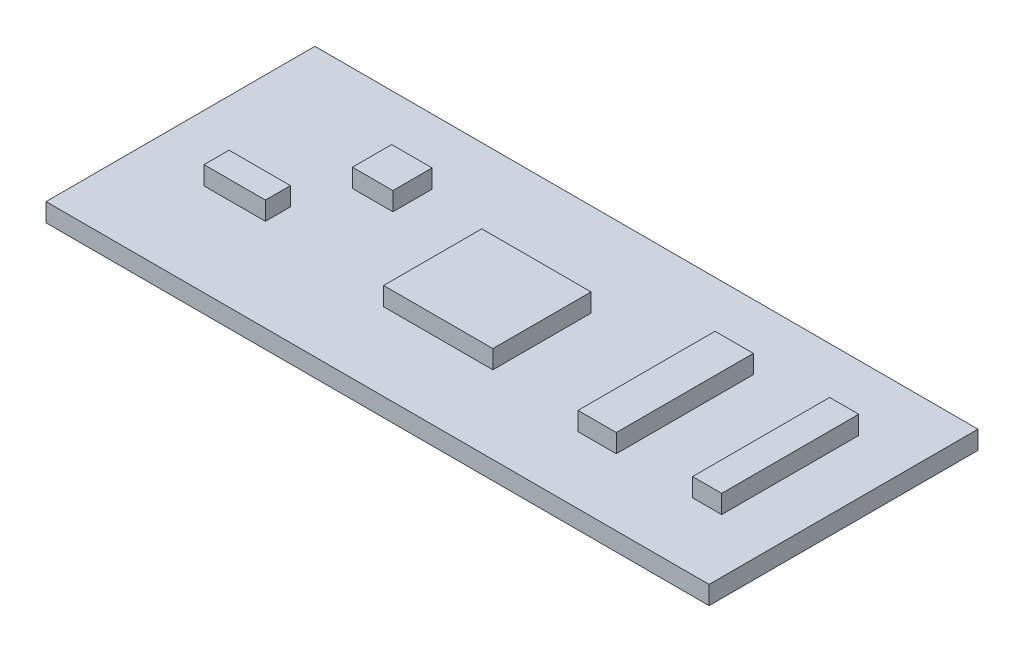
ISO-10303-21;
HEADER;
FILE_DESCRIPTION(('STEP AP214'),'2;1');
FILE_NAME('part.step','',(''),(''),'','','');
FILE_SCHEMA(('AUTOMOTIVE_DESIGN { 1 0 10303 214 1 1 1 1 }'));
ENDSEC;
DATA;
#1=APPLICATION_CONTEXT('core data for automotive mechanical design processes');
#2=APPLICATION_PROTOCOL_DEFINITION('international standard','automotive_design',2000,#1);
#3=PRODUCT_CONTEXT('',#1,'mechanical');
#4=PRODUCT('Part','Part','',(#3));
#5=PRODUCT_RELATED_PRODUCT_CATEGORY('part','',(#4));
#6=PRODUCT_DEFINITION_FORMATION('','',#4);
#7=PRODUCT_DEFINITION_CONTEXT('part definition',#1,'design');
#8=PRODUCT_DEFINITION('design','',#6,#7);
#9=PRODUCT_DEFINITION_SHAPE('','',#8);
#10=(LENGTH_UNIT() NAMED_UNIT(*) SI_UNIT(.MILLI.,.METRE.));
#11=(NAMED_UNIT(*) PLANE_ANGLE_UNIT() SI_UNIT($,.RADIAN.));
#12=(NAMED_UNIT(*) SI_UNIT($,.STERADIAN.) SOLID_ANGLE_UNIT());
#13=UNCERTAINTY_MEASURE_WITH_UNIT(LENGTH_MEASURE(1.E-05),#10,'distance_accuracy_value','');
#14=(GEOMETRIC_REPRESENTATION_CONTEXT(3) GLOBAL_UNCERTAINTY_ASSIGNED_CONTEXT((#13)) GLOBAL_UNIT_ASSIGNED_CONTEXT((#10,
#11,#12)) REPRESENTATION_CONTEXT('',''));
#15=CARTESIAN_POINT('',(0.,0.,0.));
#16=DIRECTION('',(0.,0.,1.));
#17=DIRECTION('',(1.,0.,0.));
#18=AXIS2_PLACEMENT_3D('',#15,#16,#17);
#19=CARTESIAN_POINT('',(0.,1.5,-21.9));
#20=DIRECTION('',(0.,1.,0.));
#21=DIRECTION('',(0.,0.,1.));
#22=AXIS2_PLACEMENT_3D('',#19,#20,#21);
#23=PLANE('',#22);
#24=DIRECTION('',(1.,0.,0.));
#25=VECTOR('',#24,1.);
#26=CARTESIAN_POINT('',(11.5516885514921,1.5,-13.403085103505));
#27=LINE('',#26,#25);
#28=CARTESIAN_POINT('',(11.5516885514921,1.5,-13.403085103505));
#29=VERTEX_POINT('',#28);
#30=CARTESIAN_POINT('',(14.846633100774,1.50000000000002,-13.403085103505));
#31=VERTEX_POINT('',#30);
#32=EDGE_CURVE('E243',#29,#31,#27,.T.);
#33=ORIENTED_EDGE('',*,*,#32,.F.);
#34=DIRECTION('',(0.,0.,1.));
#35=VECTOR('',#34,1.);
#36=CARTESIAN_POINT('',(11.5516885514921,1.49999999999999,-16.5958756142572));
#37=LINE('',#36,#35);
#38=CARTESIAN_POINT('',(11.5516885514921,1.49999999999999,-16.5958756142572));
#39=VERTEX_POINT('',#38);
#40=EDGE_CURVE('E212',#39,#29,#37,.T.);
#41=ORIENTED_EDGE('',*,*,#40,.F.);
#42=DIRECTION('',(-1.,0.,0.));
#43=VECTOR('',#42,1.);
#44=CARTESIAN_POINT('',(11.5516885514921,1.49999999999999,-16.5958756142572));
#45=LINE('',#44,#43);
#46=CARTESIAN_POINT('',(14.8466331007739,1.49999999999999,-16.5958756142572));
#47=VERTEX_POINT('',#46);
#48=EDGE_CURVE('E247',#47,#39,#45,.T.);
#49=ORIENTED_EDGE('',*,*,#48,.F.);
#50=DIRECTION('',(0.,0.,-1.));
#51=VECTOR('',#50,1.);
#52=CARTESIAN_POINT('',(14.8466331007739,1.49999999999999,-16.5958756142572));
#53=LINE('',#52,#51);
#54=EDGE_CURVE('E245',#31,#47,#53,.T.);
#55=ORIENTED_EDGE('',*,*,#54,.F.);
#56=EDGE_LOOP('',(#33,#41,#49,#55));
#57=FACE_BOUND('',#56,.T.);
#58=DIRECTION('',(0.,0.,-1.));
#59=VECTOR('',#58,1.);
#60=CARTESIAN_POINT('',(30.061828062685,1.50000000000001,-14.3228832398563));
#61=LINE('',#60,#59);
#62=CARTESIAN_POINT('',(30.061828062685,1.49999999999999,-6.33009558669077));
#63=VERTEX_POINT('',#62);
#64=CARTESIAN_POINT('',(30.061828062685,1.50000000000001,-14.3228832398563));
#65=VERTEX_POINT('',#64);
#66=EDGE_CURVE('E301',#63,#65,#61,.T.);
#67=ORIENTED_EDGE('',*,*,#66,.F.);
#68=DIRECTION('',(1.,0.,0.));
#69=VECTOR('',#68,1.);
#70=CARTESIAN_POINT('',(21.1643509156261,1.5,-6.33009558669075));
#71=LINE('',#70,#69);
#72=CARTESIAN_POINT('',(21.1643509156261,1.5,-6.33009558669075));
#73=VERTEX_POINT('',#72);
#74=EDGE_CURVE('E299',#73,#63,#71,.T.);
#75=ORIENTED_EDGE('',*,*,#74,.F.);
#76=DIRECTION('',(0.,0.,1.));
#77=VECTOR('',#76,1.);
#78=CARTESIAN_POINT('',(21.164350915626,1.49999999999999,-14.3228832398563));
#79=LINE('',#78,#77);
#80=CARTESIAN_POINT('',(21.164350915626,1.49999999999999,-14.3228832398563));
#81=VERTEX_POINT('',#80);
#82=EDGE_CURVE('E296',#81,#73,#79,.T.);
#83=ORIENTED_EDGE('',*,*,#82,.F.);
#84=DIRECTION('',(-1.,0.,0.));
#85=VECTOR('',#84,1.);
#86=CARTESIAN_POINT('',(21.164350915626,1.49999999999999,-14.3228832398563));
#87=LINE('',#86,#85);
#88=EDGE_CURVE('E304',#65,#81,#87,.T.);
#89=ORIENTED_EDGE('',*,*,#88,.F.);
#90=EDGE_LOOP('',(#67,#75,#83,#89));
#91=FACE_BOUND('',#90,.T.);
#92=DIRECTION('',(-1.,0.,0.));
#93=VECTOR('',#92,1.);
#94=CARTESIAN_POINT('',(0.,1.49999999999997,0.));
#95=LINE('',#94,#93);
#96=CARTESIAN_POINT('',(54.,1.5,0.));
#97=VERTEX_POINT('',#96);
#98=CARTESIAN_POINT('',(0.,1.49999999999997,0.));
#99=VERTEX_POINT('',#98);
#100=EDGE_CURVE('E363',#97,#99,#95,.T.);
#101=ORIENTED_EDGE('',*,*,#100,.F.);
#102=DIRECTION('',(0.,0.,1.));
#103=VECTOR('',#102,1.);
#104=CARTESIAN_POINT('',(54.,1.50000000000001,-21.9));
#105=LINE('',#104,#103);
#106=CARTESIAN_POINT('',(54.,1.50000000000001,-21.9));
#107=VERTEX_POINT('',#106);
#108=EDGE_CURVE('E47',#107,#97,#105,.T.);
#109=ORIENTED_EDGE('',*,*,#108,.F.);
#110=DIRECTION('',(-1.,0.,0.));
#111=VECTOR('',#110,1.);
#112=CARTESIAN_POINT('',(0.,1.5,-21.9));
#113=LINE('',#112,#111);
#114=CARTESIAN_POINT('',(0.,1.5,-21.9));
#115=VERTEX_POINT('',#114);
#116=EDGE_CURVE('E375',#107,#115,#113,.T.);
#117=ORIENTED_EDGE('',*,*,#116,.T.);
#118=DIRECTION('',(0.,0.,1.));
#119=VECTOR('',#118,1.);
#120=CARTESIAN_POINT('',(0.,1.5,-21.9));
#121=LINE('',#120,#119);
#122=EDGE_CURVE('E11',#115,#99,#121,.T.);
#123=ORIENTED_EDGE('',*,*,#122,.T.);
#124=EDGE_LOOP('',(#101,#109,#117,#123));
#125=FACE_BOUND('',#124,.T.);
#126=DIRECTION('',(0.,0.,-1.));
#127=VECTOR('',#126,1.);
#128=CARTESIAN_POINT('',(10.3267564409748,1.49999999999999,-7.54155203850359));
#129=LINE('',#128,#127);
#130=CARTESIAN_POINT('',(10.3267564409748,1.49999999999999,-7.54155203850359));
#131=VERTEX_POINT('',#130);
#132=CARTESIAN_POINT('',(10.3267564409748,1.5,-9.57971420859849));
#133=VERTEX_POINT('',#132);
#134=EDGE_CURVE('E330',#131,#133,#129,.T.);
#135=ORIENTED_EDGE('',*,*,#134,.F.);
#136=DIRECTION('',(1.,0.,0.));
#137=VECTOR('',#136,1.);
#138=CARTESIAN_POINT('',(5.3284447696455,1.49999999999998,-7.54155203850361));
#139=LINE('',#138,#137);
#140=CARTESIAN_POINT('',(5.3284447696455,1.49999999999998,-7.54155203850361));
#141=VERTEX_POINT('',#140);
#142=EDGE_CURVE('E328',#141,#131,#139,.T.);
#143=ORIENTED_EDGE('',*,*,#142,.F.);
#144=DIRECTION('',(0.,0.,1.));
#145=VECTOR('',#144,1.);
#146=CARTESIAN_POINT('',(5.3284447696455,1.49999999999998,-7.54155203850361));
#147=LINE('',#146,#145);
#148=CARTESIAN_POINT('',(5.3284447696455,1.5,-9.57971420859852));
#149=VERTEX_POINT('',#148);
#150=EDGE_CURVE('E325',#149,#141,#147,.T.);
#151=ORIENTED_EDGE('',*,*,#150,.F.);
#152=DIRECTION('',(-1.,0.,0.));
#153=VECTOR('',#152,1.);
#154=CARTESIAN_POINT('',(5.3284447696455,1.5,-9.57971420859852));
#155=LINE('',#154,#153);
#156=EDGE_CURVE('E333',#133,#149,#155,.T.);
#157=ORIENTED_EDGE('',*,*,#156,.F.);
#158=EDGE_LOOP('',(#135,#143,#151,#157));
#159=FACE_BOUND('',#158,.T.);
#160=DIRECTION('',(-1.,0.,0.));
#161=VECTOR('',#160,1.);
#162=CARTESIAN_POINT('',(41.0081798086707,1.50000000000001,-16.5958756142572));
#163=LINE('',#162,#161);
#164=CARTESIAN_POINT('',(41.0081798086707,1.50000000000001,-16.5958756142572));
#165=VERTEX_POINT('',#164);
#166=CARTESIAN_POINT('',(37.8898379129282,1.49999999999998,-16.5958756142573));
#167=VERTEX_POINT('',#166);
#168=EDGE_CURVE('E270',#165,#167,#163,.T.);
#169=ORIENTED_EDGE('',*,*,#168,.F.);
#170=DIRECTION('',(0.,0.,-1.));
#171=VECTOR('',#170,1.);
#172=CARTESIAN_POINT('',(41.0081798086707,1.5,-5.43584932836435));
#173=LINE('',#172,#171);
#174=CARTESIAN_POINT('',(41.0081798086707,1.5,-5.43584932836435));
#175=VERTEX_POINT('',#174);
#176=EDGE_CURVE('E267',#175,#165,#173,.T.);
#177=ORIENTED_EDGE('',*,*,#176,.F.);
#178=DIRECTION('',(1.,0.,0.));
#179=VECTOR('',#178,1.);
#180=CARTESIAN_POINT('',(41.0081798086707,1.5,-5.43584932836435));
#181=LINE('',#180,#179);
#182=CARTESIAN_POINT('',(37.8898379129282,1.5,-5.43584932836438));
#183=VERTEX_POINT('',#182);
#184=EDGE_CURVE('E275',#183,#175,#181,.T.);
#185=ORIENTED_EDGE('',*,*,#184,.F.);
#186=DIRECTION('',(0.,0.,1.));
#187=VECTOR('',#186,1.);
#188=CARTESIAN_POINT('',(37.8898379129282,1.5,-5.43584932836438));
#189=LINE('',#188,#187);
#190=EDGE_CURVE('E272',#167,#183,#189,.T.);
#191=ORIENTED_EDGE('',*,*,#190,.F.);
#192=EDGE_LOOP('',(#169,#177,#185,#191));
#193=FACE_BOUND('',#192,.T.);
#194=DIRECTION('',(0.,0.,-1.));
#195=VECTOR('',#194,1.);
#196=CARTESIAN_POINT('',(49.5900975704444,1.50000000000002,-5.43584932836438));
#197=LINE('',#196,#195);
#198=CARTESIAN_POINT('',(49.5900975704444,1.50000000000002,-5.43584932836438));
#199=VERTEX_POINT('',#198);
#200=CARTESIAN_POINT('',(49.5900975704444,1.5,-16.5958756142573));
#201=VERTEX_POINT('',#200);
#202=EDGE_CURVE('E225',#199,#201,#197,.T.);
#203=ORIENTED_EDGE('',*,*,#202,.F.);
#204=DIRECTION('',(1.,0.,0.));
#205=VECTOR('',#204,1.);
#206=CARTESIAN_POINT('',(47.2218057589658,1.5,-5.4358493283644));
#207=LINE('',#206,#205);
#208=CARTESIAN_POINT('',(47.2218057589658,1.5,-5.4358493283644));
#209=VERTEX_POINT('',#208);
#210=EDGE_CURVE('E206',#209,#199,#207,.T.);
#211=ORIENTED_EDGE('',*,*,#210,.F.);
#212=DIRECTION('',(0.,0.,1.));
#213=VECTOR('',#212,1.);
#214=CARTESIAN_POINT('',(47.2218057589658,1.5,-5.4358493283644));
#215=LINE('',#214,#213);
#216=CARTESIAN_POINT('',(47.2218057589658,1.50000000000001,-16.5958756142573));
#217=VERTEX_POINT('',#216);
#218=EDGE_CURVE('E217',#217,#209,#215,.T.);
#219=ORIENTED_EDGE('',*,*,#218,.F.);
#220=DIRECTION('',(-1.,0.,0.));
#221=VECTOR('',#220,1.);
#222=CARTESIAN_POINT('',(47.2218057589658,1.50000000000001,-16.5958756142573));
#223=LINE('',#222,#221);
#224=EDGE_CURVE('E227',#201,#217,#223,.T.);
#225=ORIENTED_EDGE('',*,*,#224,.F.);
#226=EDGE_LOOP('',(#203,#211,#219,#225));
#227=FACE_BOUND('',#226,.T.);
#228=ADVANCED_FACE('F38',(#57,#91,#125,#159,#193,#227),#23,.T.);
#229=CARTESIAN_POINT('',(0.,0.,-21.9));
#230=DIRECTION('',(-1.,0.,0.));
#231=DIRECTION('',(0.,0.,1.));
#232=AXIS2_PLACEMENT_3D('',#229,#230,#231);
#233=PLANE('',#232);
#234=DIRECTION('',(0.,-1.,0.));
#235=VECTOR('',#234,1.);
#236=CARTESIAN_POINT('',(0.,0.,0.));
#237=LINE('',#236,#235);
#238=CARTESIAN_POINT('',(0.,0.,0.));
#239=VERTEX_POINT('',#238);
#240=EDGE_CURVE('E354',#99,#239,#237,.T.);
#241=ORIENTED_EDGE('',*,*,#240,.F.);
#242=ORIENTED_EDGE('',*,*,#122,.F.);
#243=DIRECTION('',(0.,-1.,0.));
#244=VECTOR('',#243,1.);
#245=CARTESIAN_POINT('',(0.,0.,-21.9));
#246=LINE('',#245,#244);
#247=CARTESIAN_POINT('',(0.,0.,-21.9));
#248=VERTEX_POINT('',#247);
#249=EDGE_CURVE('E366',#115,#248,#246,.T.);
#250=ORIENTED_EDGE('',*,*,#249,.T.);
#251=DIRECTION('',(0.,0.,1.));
#252=VECTOR('',#251,1.);
#253=CARTESIAN_POINT('',(0.,0.,-21.9));
#254=LINE('',#253,#252);
#255=EDGE_CURVE('E42',#248,#239,#254,.T.);
#256=ORIENTED_EDGE('',*,*,#255,.T.);
#257=EDGE_LOOP('',(#241,#242,#250,#256));
#258=FACE_BOUND('',#257,.T.);
#259=ADVANCED_FACE('F40',(#258),#233,.T.);
#260=CARTESIAN_POINT('',(54.,0.,-21.9));
#261=DIRECTION('',(1.,0.,0.));
#262=DIRECTION('',(0.,0.,-1.));
#263=AXIS2_PLACEMENT_3D('',#260,#261,#262);
#264=PLANE('',#263);
#265=DIRECTION('',(0.,1.,0.));
#266=VECTOR('',#265,1.);
#267=CARTESIAN_POINT('',(54.,0.,0.));
#268=LINE('',#267,#266);
#269=CARTESIAN_POINT('',(54.,0.,0.));
#270=VERTEX_POINT('',#269);
#271=EDGE_CURVE('E360',#270,#97,#268,.T.);
#272=ORIENTED_EDGE('',*,*,#271,.F.);
#273=DIRECTION('',(0.,0.,1.));
#274=VECTOR('',#273,1.);
#275=CARTESIAN_POINT('',(54.,0.,-21.9));
#276=LINE('',#275,#274);
#277=CARTESIAN_POINT('',(54.,0.,-21.9));
#278=VERTEX_POINT('',#277);
#279=EDGE_CURVE('E378',#278,#270,#276,.T.);
#280=ORIENTED_EDGE('',*,*,#279,.F.);
#281=DIRECTION('',(0.,1.,0.));
#282=VECTOR('',#281,1.);
#283=CARTESIAN_POINT('',(54.,0.,-21.9));
#284=LINE('',#283,#282);
#285=EDGE_CURVE('E372',#278,#107,#284,.T.);
#286=ORIENTED_EDGE('',*,*,#285,.T.);
#287=ORIENTED_EDGE('',*,*,#108,.T.);
#288=EDGE_LOOP('',(#272,#280,#286,#287));
#289=FACE_BOUND('',#288,.T.);
#290=ADVANCED_FACE('F397',(#289),#264,.T.);
#291=CARTESIAN_POINT('',(0.,0.,-21.9));
#292=DIRECTION('',(0.,-1.,0.));
#293=DIRECTION('',(0.,0.,-1.));
#294=AXIS2_PLACEMENT_3D('',#291,#292,#293);
#295=PLANE('',#294);
#296=DIRECTION('',(1.,0.,0.));
#297=VECTOR('',#296,1.);
#298=CARTESIAN_POINT('',(0.,0.,0.));
#299=LINE('',#298,#297);
#300=EDGE_CURVE('E357',#239,#270,#299,.T.);
#301=ORIENTED_EDGE('',*,*,#300,.F.);
#302=ORIENTED_EDGE('',*,*,#255,.F.);
#303=DIRECTION('',(1.,0.,0.));
#304=VECTOR('',#303,1.);
#305=CARTESIAN_POINT('',(0.,0.,-21.9));
#306=LINE('',#305,#304);
#307=EDGE_CURVE('E369',#248,#278,#306,.T.);
#308=ORIENTED_EDGE('',*,*,#307,.T.);
#309=ORIENTED_EDGE('',*,*,#279,.T.);
#310=EDGE_LOOP('',(#301,#302,#308,#309));
#311=FACE_BOUND('',#310,.T.);
#312=ADVANCED_FACE('F386',(#311),#295,.T.);
#313=CARTESIAN_POINT('',(0.,1.5,-21.9));
#314=DIRECTION('',(0.,0.,-1.));
#315=DIRECTION('',(-1.,0.,0.));
#316=AXIS2_PLACEMENT_3D('',#313,#314,#315);
#317=PLANE('',#316);
#318=ORIENTED_EDGE('',*,*,#249,.F.);
#319=ORIENTED_EDGE('',*,*,#116,.F.);
#320=ORIENTED_EDGE('',*,*,#285,.F.);
#321=ORIENTED_EDGE('',*,*,#307,.F.);
#322=EDGE_LOOP('',(#318,#319,#320,#321));
#323=FACE_BOUND('',#322,.T.);
#324=ADVANCED_FACE('F394',(#323),#317,.T.);
#325=CARTESIAN_POINT('',(0.,1.49999999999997,0.));
#326=DIRECTION('',(0.,0.,-1.));
#327=DIRECTION('',(-1.,0.,0.));
#328=AXIS2_PLACEMENT_3D('',#325,#326,#327);
#329=PLANE('',#328);
#330=ORIENTED_EDGE('',*,*,#240,.T.);
#331=ORIENTED_EDGE('',*,*,#300,.T.);
#332=ORIENTED_EDGE('',*,*,#271,.T.);
#333=ORIENTED_EDGE('',*,*,#100,.T.);
#334=EDGE_LOOP('',(#330,#331,#332,#333));
#335=FACE_BOUND('',#334,.T.);
#336=ADVANCED_FACE('F388',(#335),#329,.F.);
#337=CARTESIAN_POINT('',(5.32844476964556,3.,-7.5415520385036));
#338=DIRECTION('',(1.,0.,0.));
#339=DIRECTION('',(0.,0.,-1.));
#340=AXIS2_PLACEMENT_3D('',#337,#338,#339);
#341=PLANE('',#340);
#342=ORIENTED_EDGE('',*,*,#150,.T.);
#343=DIRECTION('',(0.,-1.,0.));
#344=VECTOR('',#343,1.);
#345=CARTESIAN_POINT('',(5.32844476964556,3.,-7.5415520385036));
#346=LINE('',#345,#344);
#347=CARTESIAN_POINT('',(5.32844476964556,3.,-7.5415520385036));
#348=VERTEX_POINT('',#347);
#349=EDGE_CURVE('E352',#348,#141,#346,.T.);
#350=ORIENTED_EDGE('',*,*,#349,.F.);
#351=DIRECTION('',(0.,0.,1.));
#352=VECTOR('',#351,1.);
#353=CARTESIAN_POINT('',(5.32844476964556,3.,-7.5415520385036));
#354=LINE('',#353,#352);
#355=CARTESIAN_POINT('',(5.3284447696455,2.99999999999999,-9.57971420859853));
#356=VERTEX_POINT('',#355);
#357=EDGE_CURVE('E335',#356,#348,#354,.T.);
#358=ORIENTED_EDGE('',*,*,#357,.F.);
#359=DIRECTION('',(0.,-1.,0.));
#360=VECTOR('',#359,1.);
#361=CARTESIAN_POINT('',(5.3284447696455,2.99999999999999,-9.57971420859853));
#362=LINE('',#361,#360);
#363=EDGE_CURVE('E344',#356,#149,#362,.T.);
#364=ORIENTED_EDGE('',*,*,#363,.T.);
#365=EDGE_LOOP('',(#342,#350,#358,#364));
#366=FACE_BOUND('',#365,.T.);
#367=ADVANCED_FACE('F416',(#366),#341,.F.);
#368=CARTESIAN_POINT('',(5.32844476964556,3.,-7.5415520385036));
#369=DIRECTION('',(0.,0.,-1.));
#370=DIRECTION('',(-1.,0.,0.));
#371=AXIS2_PLACEMENT_3D('',#368,#369,#370);
#372=PLANE('',#371);
#373=ORIENTED_EDGE('',*,*,#142,.T.);
#374=DIRECTION('',(0.,-1.,0.));
#375=VECTOR('',#374,1.);
#376=CARTESIAN_POINT('',(10.3267564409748,3.00000000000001,-7.5415520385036));
#377=LINE('',#376,#375);
#378=CARTESIAN_POINT('',(10.3267564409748,3.00000000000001,-7.5415520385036));
#379=VERTEX_POINT('',#378);
#380=EDGE_CURVE('E349',#379,#131,#377,.T.);
#381=ORIENTED_EDGE('',*,*,#380,.F.);
#382=DIRECTION('',(1.,0.,0.));
#383=VECTOR('',#382,1.);
#384=CARTESIAN_POINT('',(5.32844476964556,3.,-7.5415520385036));
#385=LINE('',#384,#383);
#386=EDGE_CURVE('E338',#348,#379,#385,.T.);
#387=ORIENTED_EDGE('',*,*,#386,.F.);
#388=ORIENTED_EDGE('',*,*,#349,.T.);
#389=EDGE_LOOP('',(#373,#381,#387,#388));
#390=FACE_BOUND('',#389,.T.);
#391=ADVANCED_FACE('F419',(#390),#372,.F.);
#392=CARTESIAN_POINT('',(10.3267564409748,3.00000000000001,-7.5415520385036));
#393=DIRECTION('',(-1.,0.,0.));
#394=DIRECTION('',(0.,0.,1.));
#395=AXIS2_PLACEMENT_3D('',#392,#393,#394);
#396=PLANE('',#395);
#397=ORIENTED_EDGE('',*,*,#134,.T.);
#398=DIRECTION('',(0.,-1.,0.));
#399=VECTOR('',#398,1.);
#400=CARTESIAN_POINT('',(10.3267564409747,2.99999999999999,-9.57971420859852));
#401=LINE('',#400,#399);
#402=CARTESIAN_POINT('',(10.3267564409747,2.99999999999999,-9.57971420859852));
#403=VERTEX_POINT('',#402);
#404=EDGE_CURVE('E347',#403,#133,#401,.T.);
#405=ORIENTED_EDGE('',*,*,#404,.F.);
#406=DIRECTION('',(0.,0.,-1.));
#407=VECTOR('',#406,1.);
#408=CARTESIAN_POINT('',(10.3267564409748,3.00000000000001,-7.5415520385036));
#409=LINE('',#408,#407);
#410=EDGE_CURVE('E340',#379,#403,#409,.T.);
#411=ORIENTED_EDGE('',*,*,#410,.F.);
#412=ORIENTED_EDGE('',*,*,#380,.T.);
#413=EDGE_LOOP('',(#397,#405,#411,#412));
#414=FACE_BOUND('',#413,.T.);
#415=ADVANCED_FACE('F423',(#414),#396,.F.);
#416=CARTESIAN_POINT('',(5.3284447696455,2.99999999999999,-9.57971420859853));
#417=DIRECTION('',(0.,0.,1.));
#418=DIRECTION('',(1.,0.,0.));
#419=AXIS2_PLACEMENT_3D('',#416,#417,#418);
#420=PLANE('',#419);
#421=ORIENTED_EDGE('',*,*,#156,.T.);
#422=ORIENTED_EDGE('',*,*,#363,.F.);
#423=DIRECTION('',(-1.,0.,0.));
#424=VECTOR('',#423,1.);
#425=CARTESIAN_POINT('',(5.3284447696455,2.99999999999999,-9.57971420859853));
#426=LINE('',#425,#424);
#427=EDGE_CURVE('E342',#403,#356,#426,.T.);
#428=ORIENTED_EDGE('',*,*,#427,.F.);
#429=ORIENTED_EDGE('',*,*,#404,.T.);
#430=EDGE_LOOP('',(#421,#422,#428,#429));
#431=FACE_BOUND('',#430,.T.);
#432=ADVANCED_FACE('F427',(#431),#420,.F.);
#433=CARTESIAN_POINT('',(5.3284447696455,2.99999999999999,-9.57971420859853));
#434=DIRECTION('',(0.,-1.,0.));
#435=DIRECTION('',(0.,0.,-1.));
#436=AXIS2_PLACEMENT_3D('',#433,#434,#435);
#437=PLANE('',#436);
#438=ORIENTED_EDGE('',*,*,#357,.T.);
#439=ORIENTED_EDGE('',*,*,#386,.T.);
#440=ORIENTED_EDGE('',*,*,#410,.T.);
#441=ORIENTED_EDGE('',*,*,#427,.T.);
#442=EDGE_LOOP('',(#438,#439,#440,#441));
#443=FACE_BOUND('',#442,.T.);
#444=ADVANCED_FACE('F431',(#443),#437,.F.);
#445=CARTESIAN_POINT('',(21.164350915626,3.00000000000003,-14.3228832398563));
#446=DIRECTION('',(1.,0.,0.));
#447=DIRECTION('',(0.,0.,-1.));
#448=AXIS2_PLACEMENT_3D('',#445,#446,#447);
#449=PLANE('',#448);
#450=ORIENTED_EDGE('',*,*,#82,.T.);
#451=DIRECTION('',(0.,-1.,0.));
#452=VECTOR('',#451,1.);
#453=CARTESIAN_POINT('',(21.164350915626,2.99999999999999,-6.33009558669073));
#454=LINE('',#453,#452);
#455=CARTESIAN_POINT('',(21.164350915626,2.99999999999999,-6.33009558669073));
#456=VERTEX_POINT('',#455);
#457=EDGE_CURVE('E323',#456,#73,#454,.T.);
#458=ORIENTED_EDGE('',*,*,#457,.F.);
#459=DIRECTION('',(0.,0.,1.));
#460=VECTOR('',#459,1.);
#461=CARTESIAN_POINT('',(21.164350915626,3.00000000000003,-14.3228832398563));
#462=LINE('',#461,#460);
#463=CARTESIAN_POINT('',(21.164350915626,3.00000000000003,-14.3228832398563));
#464=VERTEX_POINT('',#463);
#465=EDGE_CURVE('E306',#464,#456,#462,.T.);
#466=ORIENTED_EDGE('',*,*,#465,.F.);
#467=DIRECTION('',(0.,-1.,0.));
#468=VECTOR('',#467,1.);
#469=CARTESIAN_POINT('',(21.164350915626,3.00000000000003,-14.3228832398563));
#470=LINE('',#469,#468);
#471=EDGE_CURVE('E315',#464,#81,#470,.T.);
#472=ORIENTED_EDGE('',*,*,#471,.T.);
#473=EDGE_LOOP('',(#450,#458,#466,#472));
#474=FACE_BOUND('',#473,.T.);
#475=ADVANCED_FACE('F435',(#474),#449,.F.);
#476=CARTESIAN_POINT('',(21.164350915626,2.99999999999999,-6.33009558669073));
#477=DIRECTION('',(0.,0.,-1.));
#478=DIRECTION('',(-1.,0.,0.));
#479=AXIS2_PLACEMENT_3D('',#476,#477,#478);
#480=PLANE('',#479);
#481=ORIENTED_EDGE('',*,*,#74,.T.);
#482=DIRECTION('',(0.,-1.,0.));
#483=VECTOR('',#482,1.);
#484=CARTESIAN_POINT('',(30.061828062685,3.00000000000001,-6.33009558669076));
#485=LINE('',#484,#483);
#486=CARTESIAN_POINT('',(30.061828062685,3.00000000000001,-6.33009558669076));
#487=VERTEX_POINT('',#486);
#488=EDGE_CURVE('E320',#487,#63,#485,.T.);
#489=ORIENTED_EDGE('',*,*,#488,.F.);
#490=DIRECTION('',(1.,0.,0.));
#491=VECTOR('',#490,1.);
#492=CARTESIAN_POINT('',(21.164350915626,2.99999999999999,-6.33009558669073));
#493=LINE('',#492,#491);
#494=EDGE_CURVE('E309',#456,#487,#493,.T.);
#495=ORIENTED_EDGE('',*,*,#494,.F.);
#496=ORIENTED_EDGE('',*,*,#457,.T.);
#497=EDGE_LOOP('',(#481,#489,#495,#496));
#498=FACE_BOUND('',#497,.T.);
#499=ADVANCED_FACE('F439',(#498),#480,.F.);
#500=CARTESIAN_POINT('',(30.0618280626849,3.,-14.3228832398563));
#501=DIRECTION('',(-1.,0.,0.));
#502=DIRECTION('',(0.,0.,1.));
#503=AXIS2_PLACEMENT_3D('',#500,#501,#502);
#504=PLANE('',#503);
#505=ORIENTED_EDGE('',*,*,#66,.T.);
#506=DIRECTION('',(0.,-1.,0.));
#507=VECTOR('',#506,1.);
#508=CARTESIAN_POINT('',(30.0618280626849,3.,-14.3228832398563));
#509=LINE('',#508,#507);
#510=CARTESIAN_POINT('',(30.0618280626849,3.,-14.3228832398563));
#511=VERTEX_POINT('',#510);
#512=EDGE_CURVE('E318',#511,#65,#509,.T.);
#513=ORIENTED_EDGE('',*,*,#512,.F.);
#514=DIRECTION('',(0.,0.,-1.));
#515=VECTOR('',#514,1.);
#516=CARTESIAN_POINT('',(30.0618280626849,3.,-14.3228832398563));
#517=LINE('',#516,#515);
#518=EDGE_CURVE('E311',#487,#511,#517,.T.);
#519=ORIENTED_EDGE('',*,*,#518,.F.);
#520=ORIENTED_EDGE('',*,*,#488,.T.);
#521=EDGE_LOOP('',(#505,#513,#519,#520));
#522=FACE_BOUND('',#521,.T.);
#523=ADVANCED_FACE('F443',(#522),#504,.F.);
#524=CARTESIAN_POINT('',(21.164350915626,3.00000000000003,-14.3228832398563));
#525=DIRECTION('',(0.,0.,1.));
#526=DIRECTION('',(1.,0.,0.));
#527=AXIS2_PLACEMENT_3D('',#524,#525,#526);
#528=PLANE('',#527);
#529=ORIENTED_EDGE('',*,*,#88,.T.);
#530=ORIENTED_EDGE('',*,*,#471,.F.);
#531=DIRECTION('',(-1.,0.,0.));
#532=VECTOR('',#531,1.);
#533=CARTESIAN_POINT('',(21.164350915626,3.00000000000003,-14.3228832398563));
#534=LINE('',#533,#532);
#535=EDGE_CURVE('E313',#511,#464,#534,.T.);
#536=ORIENTED_EDGE('',*,*,#535,.F.);
#537=ORIENTED_EDGE('',*,*,#512,.T.);
#538=EDGE_LOOP('',(#529,#530,#536,#537));
#539=FACE_BOUND('',#538,.T.);
#540=ADVANCED_FACE('F447',(#539),#528,.F.);
#541=CARTESIAN_POINT('',(21.164350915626,2.99999999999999,-6.33009558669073));
#542=DIRECTION('',(0.,1.,0.));
#543=DIRECTION('',(0.,0.,1.));
#544=AXIS2_PLACEMENT_3D('',#541,#542,#543);
#545=PLANE('',#544);
#546=ORIENTED_EDGE('',*,*,#465,.T.);
#547=ORIENTED_EDGE('',*,*,#494,.T.);
#548=ORIENTED_EDGE('',*,*,#518,.T.);
#549=ORIENTED_EDGE('',*,*,#535,.T.);
#550=EDGE_LOOP('',(#546,#547,#548,#549));
#551=FACE_BOUND('',#550,.T.);
#552=ADVANCED_FACE('F451',(#551),#545,.T.);
#553=CARTESIAN_POINT('',(41.0081798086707,2.99999999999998,-5.43584932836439));
#554=DIRECTION('',(-1.,0.,0.));
#555=DIRECTION('',(0.,0.,1.));
#556=AXIS2_PLACEMENT_3D('',#553,#554,#555);
#557=PLANE('',#556);
#558=ORIENTED_EDGE('',*,*,#176,.T.);
#559=DIRECTION('',(0.,-1.,0.));
#560=VECTOR('',#559,1.);
#561=CARTESIAN_POINT('',(41.0081798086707,2.99999999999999,-16.5958756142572));
#562=LINE('',#561,#560);
#563=CARTESIAN_POINT('',(41.0081798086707,2.99999999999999,-16.5958756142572));
#564=VERTEX_POINT('',#563);
#565=EDGE_CURVE('E294',#564,#165,#562,.T.);
#566=ORIENTED_EDGE('',*,*,#565,.F.);
#567=DIRECTION('',(0.,0.,-1.));
#568=VECTOR('',#567,1.);
#569=CARTESIAN_POINT('',(41.0081798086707,2.99999999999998,-5.43584932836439));
#570=LINE('',#569,#568);
#571=CARTESIAN_POINT('',(41.0081798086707,2.99999999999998,-5.43584932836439));
#572=VERTEX_POINT('',#571);
#573=EDGE_CURVE('E277',#572,#564,#570,.T.);
#574=ORIENTED_EDGE('',*,*,#573,.F.);
#575=DIRECTION('',(0.,-1.,0.));
#576=VECTOR('',#575,1.);
#577=CARTESIAN_POINT('',(41.0081798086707,2.99999999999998,-5.43584932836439));
#578=LINE('',#577,#576);
#579=EDGE_CURVE('E286',#572,#175,#578,.T.);
#580=ORIENTED_EDGE('',*,*,#579,.T.);
#581=EDGE_LOOP('',(#558,#566,#574,#580));
#582=FACE_BOUND('',#581,.T.);
#583=ADVANCED_FACE('F455',(#582),#557,.F.);
#584=CARTESIAN_POINT('',(41.0081798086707,2.99999999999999,-16.5958756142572));
#585=DIRECTION('',(0.,0.,1.));
#586=DIRECTION('',(1.,0.,0.));
#587=AXIS2_PLACEMENT_3D('',#584,#585,#586);
#588=PLANE('',#587);
#589=ORIENTED_EDGE('',*,*,#168,.T.);
#590=DIRECTION('',(0.,-1.,0.));
#591=VECTOR('',#590,1.);
#592=CARTESIAN_POINT('',(37.8898379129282,3.00000000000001,-16.5958756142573));
#593=LINE('',#592,#591);
#594=CARTESIAN_POINT('',(37.8898379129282,3.00000000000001,-16.5958756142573));
#595=VERTEX_POINT('',#594);
#596=EDGE_CURVE('E291',#595,#167,#593,.T.);
#597=ORIENTED_EDGE('',*,*,#596,.F.);
#598=DIRECTION('',(-1.,0.,0.));
#599=VECTOR('',#598,1.);
#600=CARTESIAN_POINT('',(41.0081798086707,2.99999999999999,-16.5958756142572));
#601=LINE('',#600,#599);
#602=EDGE_CURVE('E280',#564,#595,#601,.T.);
#603=ORIENTED_EDGE('',*,*,#602,.F.);
#604=ORIENTED_EDGE('',*,*,#565,.T.);
#605=EDGE_LOOP('',(#589,#597,#603,#604));
#606=FACE_BOUND('',#605,.T.);
#607=ADVANCED_FACE('F459',(#606),#588,.F.);
#608=CARTESIAN_POINT('',(37.8898379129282,2.99999999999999,-5.43584932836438));
#609=DIRECTION('',(1.,0.,0.));
#610=DIRECTION('',(0.,0.,-1.));
#611=AXIS2_PLACEMENT_3D('',#608,#609,#610);
#612=PLANE('',#611);
#613=ORIENTED_EDGE('',*,*,#190,.T.);
#614=DIRECTION('',(0.,-1.,0.));
#615=VECTOR('',#614,1.);
#616=CARTESIAN_POINT('',(37.8898379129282,2.99999999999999,-5.43584932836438));
#617=LINE('',#616,#615);
#618=CARTESIAN_POINT('',(37.8898379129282,2.99999999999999,-5.43584932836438));
#619=VERTEX_POINT('',#618);
#620=EDGE_CURVE('E289',#619,#183,#617,.T.);
#621=ORIENTED_EDGE('',*,*,#620,.F.);
#622=DIRECTION('',(0.,0.,1.));
#623=VECTOR('',#622,1.);
#624=CARTESIAN_POINT('',(37.8898379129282,2.99999999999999,-5.43584932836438));
#625=LINE('',#624,#623);
#626=EDGE_CURVE('E282',#595,#619,#625,.T.);
#627=ORIENTED_EDGE('',*,*,#626,.F.);
#628=ORIENTED_EDGE('',*,*,#596,.T.);
#629=EDGE_LOOP('',(#613,#621,#627,#628));
#630=FACE_BOUND('',#629,.T.);
#631=ADVANCED_FACE('F463',(#630),#612,.F.);
#632=CARTESIAN_POINT('',(41.0081798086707,2.99999999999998,-5.43584932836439));
#633=DIRECTION('',(0.,0.,-1.));
#634=DIRECTION('',(-1.,0.,0.));
#635=AXIS2_PLACEMENT_3D('',#632,#633,#634);
#636=PLANE('',#635);
#637=ORIENTED_EDGE('',*,*,#184,.T.);
#638=ORIENTED_EDGE('',*,*,#579,.F.);
#639=DIRECTION('',(1.,0.,0.));
#640=VECTOR('',#639,1.);
#641=CARTESIAN_POINT('',(41.0081798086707,2.99999999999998,-5.43584932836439));
#642=LINE('',#641,#640);
#643=EDGE_CURVE('E284',#619,#572,#642,.T.);
#644=ORIENTED_EDGE('',*,*,#643,.F.);
#645=ORIENTED_EDGE('',*,*,#620,.T.);
#646=EDGE_LOOP('',(#637,#638,#644,#645));
#647=FACE_BOUND('',#646,.T.);
#648=ADVANCED_FACE('F467',(#647),#636,.F.);
#649=CARTESIAN_POINT('',(41.0081798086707,2.99999999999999,-16.5958756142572));
#650=DIRECTION('',(0.,1.,0.));
#651=DIRECTION('',(0.,0.,1.));
#652=AXIS2_PLACEMENT_3D('',#649,#650,#651);
#653=PLANE('',#652);
#654=ORIENTED_EDGE('',*,*,#573,.T.);
#655=ORIENTED_EDGE('',*,*,#602,.T.);
#656=ORIENTED_EDGE('',*,*,#626,.T.);
#657=ORIENTED_EDGE('',*,*,#643,.T.);
#658=EDGE_LOOP('',(#654,#655,#656,#657));
#659=FACE_BOUND('',#658,.T.);
#660=ADVANCED_FACE('F471',(#659),#653,.T.);
#661=CARTESIAN_POINT('',(11.5516885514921,3.00000000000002,-16.5958756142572));
#662=DIRECTION('',(1.,0.,0.));
#663=DIRECTION('',(0.,0.,-1.));
#664=AXIS2_PLACEMENT_3D('',#661,#662,#663);
#665=PLANE('',#664);
#666=ORIENTED_EDGE('',*,*,#40,.T.);
#667=DIRECTION('',(0.,-1.,0.));
#668=VECTOR('',#667,1.);
#669=CARTESIAN_POINT('',(11.5516885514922,3.00000000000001,-13.403085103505));
#670=LINE('',#669,#668);
#671=CARTESIAN_POINT('',(11.5516885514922,3.00000000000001,-13.403085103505));
#672=VERTEX_POINT('',#671);
#673=EDGE_CURVE('E265',#672,#29,#670,.T.);
#674=ORIENTED_EDGE('',*,*,#673,.F.);
#675=DIRECTION('',(0.,0.,1.));
#676=VECTOR('',#675,1.);
#677=CARTESIAN_POINT('',(11.5516885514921,3.00000000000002,-16.5958756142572));
#678=LINE('',#677,#676);
#679=CARTESIAN_POINT('',(11.5516885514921,3.00000000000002,-16.5958756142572));
#680=VERTEX_POINT('',#679);
#681=EDGE_CURVE('E249',#680,#672,#678,.T.);
#682=ORIENTED_EDGE('',*,*,#681,.F.);
#683=DIRECTION('',(0.,-1.,0.));
#684=VECTOR('',#683,1.);
#685=CARTESIAN_POINT('',(11.5516885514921,3.00000000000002,-16.5958756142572));
#686=LINE('',#685,#684);
#687=EDGE_CURVE('E258',#680,#39,#686,.T.);
#688=ORIENTED_EDGE('',*,*,#687,.T.);
#689=EDGE_LOOP('',(#666,#674,#682,#688));
#690=FACE_BOUND('',#689,.T.);
#691=ADVANCED_FACE('F475',(#690),#665,.F.);
#692=CARTESIAN_POINT('',(11.5516885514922,3.00000000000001,-13.403085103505));
#693=DIRECTION('',(0.,0.,-1.));
#694=DIRECTION('',(-1.,0.,0.));
#695=AXIS2_PLACEMENT_3D('',#692,#693,#694);
#696=PLANE('',#695);
#697=ORIENTED_EDGE('',*,*,#32,.T.);
#698=DIRECTION('',(0.,-1.,0.));
#699=VECTOR('',#698,1.);
#700=CARTESIAN_POINT('',(14.846633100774,3.00000000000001,-13.403085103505));
#701=LINE('',#700,#699);
#702=CARTESIAN_POINT('',(14.846633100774,3.00000000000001,-13.403085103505));
#703=VERTEX_POINT('',#702);
#704=EDGE_CURVE('E262',#703,#31,#701,.T.);
#705=ORIENTED_EDGE('',*,*,#704,.F.);
#706=DIRECTION('',(1.,0.,0.));
#707=VECTOR('',#706,1.);
#708=CARTESIAN_POINT('',(11.5516885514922,3.00000000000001,-13.403085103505));
#709=LINE('',#708,#707);
#710=EDGE_CURVE('E252',#672,#703,#709,.T.);
#711=ORIENTED_EDGE('',*,*,#710,.F.);
#712=ORIENTED_EDGE('',*,*,#673,.T.);
#713=EDGE_LOOP('',(#697,#705,#711,#712));
#714=FACE_BOUND('',#713,.T.);
#715=ADVANCED_FACE('F479',(#714),#696,.F.);
#716=CARTESIAN_POINT('',(14.8466331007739,3.,-16.5958756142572));
#717=DIRECTION('',(-1.,0.,0.));
#718=DIRECTION('',(0.,0.,1.));
#719=AXIS2_PLACEMENT_3D('',#716,#717,#718);
#720=PLANE('',#719);
#721=ORIENTED_EDGE('',*,*,#54,.T.);
#722=DIRECTION('',(0.,-1.,0.));
#723=VECTOR('',#722,1.);
#724=CARTESIAN_POINT('',(14.8466331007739,3.,-16.5958756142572));
#725=LINE('',#724,#723);
#726=CARTESIAN_POINT('',(14.8466331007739,3.,-16.5958756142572));
#727=VERTEX_POINT('',#726);
#728=EDGE_CURVE('E63',#727,#47,#725,.T.);
#729=ORIENTED_EDGE('',*,*,#728,.F.);
#730=DIRECTION('',(0.,0.,-1.));
#731=VECTOR('',#730,1.);
#732=CARTESIAN_POINT('',(14.8466331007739,3.,-16.5958756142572));
#733=LINE('',#732,#731);
#734=EDGE_CURVE('E254',#703,#727,#733,.T.);
#735=ORIENTED_EDGE('',*,*,#734,.F.);
#736=ORIENTED_EDGE('',*,*,#704,.T.);
#737=EDGE_LOOP('',(#721,#729,#735,#736));
#738=FACE_BOUND('',#737,.T.);
#739=ADVANCED_FACE('F483',(#738),#720,.F.);
#740=CARTESIAN_POINT('',(11.5516885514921,3.00000000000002,-16.5958756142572));
#741=DIRECTION('',(0.,0.,1.));
#742=DIRECTION('',(1.,0.,0.));
#743=AXIS2_PLACEMENT_3D('',#740,#741,#742);
#744=PLANE('',#743);
#745=ORIENTED_EDGE('',*,*,#48,.T.);
#746=ORIENTED_EDGE('',*,*,#687,.F.);
#747=DIRECTION('',(-1.,0.,0.));
#748=VECTOR('',#747,1.);
#749=CARTESIAN_POINT('',(11.5516885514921,3.00000000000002,-16.5958756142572));
#750=LINE('',#749,#748);
#751=EDGE_CURVE('E256',#727,#680,#750,.T.);
#752=ORIENTED_EDGE('',*,*,#751,.F.);
#753=ORIENTED_EDGE('',*,*,#728,.T.);
#754=EDGE_LOOP('',(#745,#746,#752,#753));
#755=FACE_BOUND('',#754,.T.);
#756=ADVANCED_FACE('F487',(#755),#744,.F.);
#757=CARTESIAN_POINT('',(11.5516885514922,3.00000000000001,-13.403085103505));
#758=DIRECTION('',(0.,1.,0.));
#759=DIRECTION('',(0.,0.,1.));
#760=AXIS2_PLACEMENT_3D('',#757,#758,#759);
#761=PLANE('',#760);
#762=ORIENTED_EDGE('',*,*,#681,.T.);
#763=ORIENTED_EDGE('',*,*,#710,.T.);
#764=ORIENTED_EDGE('',*,*,#734,.T.);
#765=ORIENTED_EDGE('',*,*,#751,.T.);
#766=EDGE_LOOP('',(#762,#763,#764,#765));
#767=FACE_BOUND('',#766,.T.);
#768=ADVANCED_FACE('F491',(#767),#761,.T.);
#769=CARTESIAN_POINT('',(47.2218057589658,3.00000000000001,-5.43584932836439));
#770=DIRECTION('',(1.,0.,0.));
#771=DIRECTION('',(0.,0.,-1.));
#772=AXIS2_PLACEMENT_3D('',#769,#770,#771);
#773=PLANE('',#772);
#774=ORIENTED_EDGE('',*,*,#218,.T.);
#775=DIRECTION('',(0.,-1.,0.));
#776=VECTOR('',#775,1.);
#777=CARTESIAN_POINT('',(47.2218057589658,3.00000000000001,-5.43584932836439));
#778=LINE('',#777,#776);
#779=CARTESIAN_POINT('',(47.2218057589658,3.00000000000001,-5.43584932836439));
#780=VERTEX_POINT('',#779);
#781=EDGE_CURVE('E201',#780,#209,#778,.T.);
#782=ORIENTED_EDGE('',*,*,#781,.F.);
#783=DIRECTION('',(0.,0.,1.));
#784=VECTOR('',#783,1.);
#785=CARTESIAN_POINT('',(47.2218057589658,3.00000000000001,-5.43584932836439));
#786=LINE('',#785,#784);
#787=CARTESIAN_POINT('',(47.2218057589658,3.,-16.5958756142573));
#788=VERTEX_POINT('',#787);
#789=EDGE_CURVE('E231',#788,#780,#786,.T.);
#790=ORIENTED_EDGE('',*,*,#789,.F.);
#791=DIRECTION('',(0.,-1.,0.));
#792=VECTOR('',#791,1.);
#793=CARTESIAN_POINT('',(47.2218057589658,3.,-16.5958756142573));
#794=LINE('',#793,#792);
#795=EDGE_CURVE('E220',#788,#217,#794,.T.);
#796=ORIENTED_EDGE('',*,*,#795,.T.);
#797=EDGE_LOOP('',(#774,#782,#790,#796));
#798=FACE_BOUND('',#797,.T.);
#799=ADVANCED_FACE('F218',(#798),#773,.F.);
#800=CARTESIAN_POINT('',(47.2218057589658,3.00000000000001,-5.43584932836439));
#801=DIRECTION('',(0.,0.,-1.));
#802=DIRECTION('',(-1.,0.,0.));
#803=AXIS2_PLACEMENT_3D('',#800,#801,#802);
#804=PLANE('',#803);
#805=ORIENTED_EDGE('',*,*,#210,.T.);
#806=DIRECTION('',(0.,-1.,0.));
#807=VECTOR('',#806,1.);
#808=CARTESIAN_POINT('',(49.5900975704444,3.,-5.4358493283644));
#809=LINE('',#808,#807);
#810=CARTESIAN_POINT('',(49.5900975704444,3.,-5.4358493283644));
#811=VERTEX_POINT('',#810);
#812=EDGE_CURVE('E213',#811,#199,#809,.T.);
#813=ORIENTED_EDGE('',*,*,#812,.F.);
#814=DIRECTION('',(1.,0.,0.));
#815=VECTOR('',#814,1.);
#816=CARTESIAN_POINT('',(47.2218057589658,3.00000000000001,-5.43584932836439));
#817=LINE('',#816,#815);
#818=EDGE_CURVE('E208',#780,#811,#817,.T.);
#819=ORIENTED_EDGE('',*,*,#818,.F.);
#820=ORIENTED_EDGE('',*,*,#781,.T.);
#821=EDGE_LOOP('',(#805,#813,#819,#820));
#822=FACE_BOUND('',#821,.T.);
#823=ADVANCED_FACE('F203',(#822),#804,.F.);
#824=CARTESIAN_POINT('',(49.5900975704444,3.,-5.4358493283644));
#825=DIRECTION('',(-1.,0.,0.));
#826=DIRECTION('',(0.,0.,1.));
#827=AXIS2_PLACEMENT_3D('',#824,#825,#826);
#828=PLANE('',#827);
#829=ORIENTED_EDGE('',*,*,#202,.T.);
#830=DIRECTION('',(0.,-1.,0.));
#831=VECTOR('',#830,1.);
#832=CARTESIAN_POINT('',(49.5900975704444,3.00000000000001,-16.5958756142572));
#833=LINE('',#832,#831);
#834=CARTESIAN_POINT('',(49.5900975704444,3.00000000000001,-16.5958756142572));
#835=VERTEX_POINT('',#834);
#836=EDGE_CURVE('E55',#835,#201,#833,.T.);
#837=ORIENTED_EDGE('',*,*,#836,.F.);
#838=DIRECTION('',(0.,0.,-1.));
#839=VECTOR('',#838,1.);
#840=CARTESIAN_POINT('',(49.5900975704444,3.,-5.4358493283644));
#841=LINE('',#840,#839);
#842=EDGE_CURVE('E234',#811,#835,#841,.T.);
#843=ORIENTED_EDGE('',*,*,#842,.F.);
#844=ORIENTED_EDGE('',*,*,#812,.T.);
#845=EDGE_LOOP('',(#829,#837,#843,#844));
#846=FACE_BOUND('',#845,.T.);
#847=ADVANCED_FACE('F499',(#846),#828,.F.);
#848=CARTESIAN_POINT('',(47.2218057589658,3.,-16.5958756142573));
#849=DIRECTION('',(0.,0.,1.));
#850=DIRECTION('',(1.,0.,0.));
#851=AXIS2_PLACEMENT_3D('',#848,#849,#850);
#852=PLANE('',#851);
#853=ORIENTED_EDGE('',*,*,#224,.T.);
#854=ORIENTED_EDGE('',*,*,#795,.F.);
#855=DIRECTION('',(-1.,0.,0.));
#856=VECTOR('',#855,1.);
#857=CARTESIAN_POINT('',(47.2218057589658,3.,-16.5958756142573));
#858=LINE('',#857,#856);
#859=EDGE_CURVE('E236',#835,#788,#858,.T.);
#860=ORIENTED_EDGE('',*,*,#859,.F.);
#861=ORIENTED_EDGE('',*,*,#836,.T.);
#862=EDGE_LOOP('',(#853,#854,#860,#861));
#863=FACE_BOUND('',#862,.T.);
#864=ADVANCED_FACE('F502',(#863),#852,.F.);
#865=CARTESIAN_POINT('',(47.2218057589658,3.,-16.5958756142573));
#866=DIRECTION('',(0.,-1.,0.));
#867=DIRECTION('',(0.,0.,-1.));
#868=AXIS2_PLACEMENT_3D('',#865,#866,#867);
#869=PLANE('',#868);
#870=ORIENTED_EDGE('',*,*,#789,.T.);
#871=ORIENTED_EDGE('',*,*,#818,.T.);
#872=ORIENTED_EDGE('',*,*,#842,.T.);
#873=ORIENTED_EDGE('',*,*,#859,.T.);
#874=EDGE_LOOP('',(#870,#871,#872,#873));
#875=FACE_BOUND('',#874,.T.);
#876=ADVANCED_FACE('F506',(#875),#869,.F.);
#877=CLOSED_SHELL('',(#228,#259,#290,#312,#324,#336,#367,#391,#415,#432,#444,#475,#499,#523,
#540,#552,#583,#607,#631,#648,#660,#691,#715,#739,#756,#768,#799,#823,#847,#864,#876));
#878=MANIFOLD_SOLID_BREP('B2',#877);
#879=ADVANCED_BREP_SHAPE_REPRESENTATION('',(#18,#878),#14);
#880=SHAPE_DEFINITION_REPRESENTATION(#9,#879);
ENDSEC;
END-ISO-10303-21;
